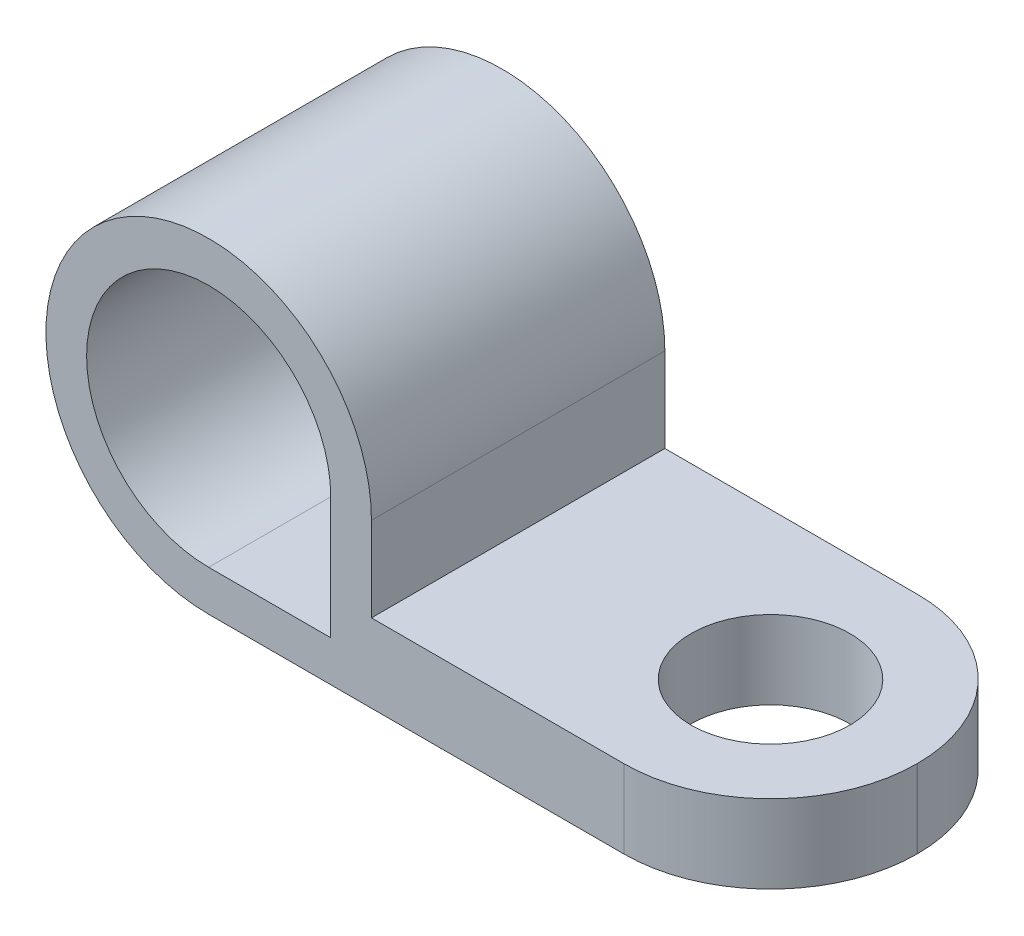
ISO-10303-21;
HEADER;
FILE_DESCRIPTION(('STEP AP214'),'2;1');
FILE_NAME('part.step','',(''),(''),'','','');
FILE_SCHEMA(('AUTOMOTIVE_DESIGN { 1 0 10303 214 1 1 1 1 }'));
ENDSEC;
DATA;
#1=APPLICATION_CONTEXT('core data for automotive mechanical design processes');
#2=APPLICATION_PROTOCOL_DEFINITION('international standard','automotive_design',2000,#1);
#3=PRODUCT_CONTEXT('',#1,'mechanical');
#4=PRODUCT('Part','Part','',(#3));
#5=PRODUCT_RELATED_PRODUCT_CATEGORY('part','',(#4));
#6=PRODUCT_DEFINITION_FORMATION('','',#4);
#7=PRODUCT_DEFINITION_CONTEXT('part definition',#1,'design');
#8=PRODUCT_DEFINITION('design','',#6,#7);
#9=PRODUCT_DEFINITION_SHAPE('','',#8);
#10=(LENGTH_UNIT() NAMED_UNIT(*) SI_UNIT(.MILLI.,.METRE.));
#11=(NAMED_UNIT(*) PLANE_ANGLE_UNIT() SI_UNIT($,.RADIAN.));
#12=(NAMED_UNIT(*) SI_UNIT($,.STERADIAN.) SOLID_ANGLE_UNIT());
#13=UNCERTAINTY_MEASURE_WITH_UNIT(LENGTH_MEASURE(1.E-05),#10,'distance_accuracy_value','');
#14=(GEOMETRIC_REPRESENTATION_CONTEXT(3) GLOBAL_UNCERTAINTY_ASSIGNED_CONTEXT((#13)) GLOBAL_UNIT_ASSIGNED_CONTEXT((#10,
#11,#12)) REPRESENTATION_CONTEXT('',''));
#15=CARTESIAN_POINT('',(0.,0.,0.));
#16=DIRECTION('',(0.,0.,1.));
#17=DIRECTION('',(1.,0.,0.));
#18=AXIS2_PLACEMENT_3D('',#15,#16,#17);
#19=CARTESIAN_POINT('',(0.,0.,4.7625));
#20=DIRECTION('',(0.,0.,1.));
#21=DIRECTION('',(1.,0.,0.));
#22=AXIS2_PLACEMENT_3D('',#19,#20,#21);
#23=PLANE('',#22);
#24=DIRECTION('',(1.,0.,0.));
#25=VECTOR('',#24,1.);
#26=CARTESIAN_POINT('',(0.,-5.2832,4.7625));
#27=LINE('',#26,#25);
#28=CARTESIAN_POINT('',(0.,-5.2832,4.7625));
#29=VERTEX_POINT('',#28);
#30=CARTESIAN_POINT('',(13.4874,-5.2832,4.7625));
#31=VERTEX_POINT('',#30);
#32=EDGE_CURVE('E510',#29,#31,#27,.T.);
#33=ORIENTED_EDGE('',*,*,#32,.T.);
#34=DIRECTION('',(0.,1.,0.));
#35=VECTOR('',#34,1.);
#36=CARTESIAN_POINT('',(13.4874,-2.74319999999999,4.7625));
#37=LINE('',#36,#35);
#38=CARTESIAN_POINT('',(13.4874,-2.7432,4.7625));
#39=VERTEX_POINT('',#38);
#40=EDGE_CURVE('E11',#31,#39,#37,.T.);
#41=ORIENTED_EDGE('',*,*,#40,.T.);
#42=DIRECTION('',(-1.,0.,0.));
#43=VECTOR('',#42,1.);
#44=CARTESIAN_POINT('',(5.2832,-2.7432,4.7625));
#45=LINE('',#44,#43);
#46=CARTESIAN_POINT('',(5.2832,-2.7432,4.7625));
#47=VERTEX_POINT('',#46);
#48=EDGE_CURVE('E512',#39,#47,#45,.T.);
#49=ORIENTED_EDGE('',*,*,#48,.T.);
#50=DIRECTION('',(0.,1.,0.));
#51=VECTOR('',#50,1.);
#52=CARTESIAN_POINT('',(5.2832,0.,4.7625));
#53=LINE('',#52,#51);
#54=CARTESIAN_POINT('',(5.2832,0.,4.7625));
#55=VERTEX_POINT('',#54);
#56=EDGE_CURVE('E514',#47,#55,#53,.T.);
#57=ORIENTED_EDGE('',*,*,#56,.T.);
#58=CARTESIAN_POINT('',(0.,0.,4.7625));
#59=DIRECTION('',(0.,0.,1.));
#60=DIRECTION('',(1.,0.,0.));
#61=AXIS2_PLACEMENT_3D('',#58,#59,#60);
#62=CIRCLE('',#61,5.2832);
#63=EDGE_CURVE('E507',#55,#29,#62,.T.);
#64=ORIENTED_EDGE('',*,*,#63,.T.);
#65=EDGE_LOOP('',(#33,#41,#49,#57,#64));
#66=FACE_BOUND('',#65,.T.);
#67=DIRECTION('',(1.,0.,0.));
#68=VECTOR('',#67,1.);
#69=CARTESIAN_POINT('',(3.9624,-3.9624,4.7625));
#70=LINE('',#69,#68);
#71=CARTESIAN_POINT('',(0.,-3.9624,4.7625));
#72=VERTEX_POINT('',#71);
#73=CARTESIAN_POINT('',(3.9624,-3.9624,4.7625));
#74=VERTEX_POINT('',#73);
#75=EDGE_CURVE('E492',#72,#74,#70,.T.);
#76=ORIENTED_EDGE('',*,*,#75,.F.);
#77=CARTESIAN_POINT('',(0.,0.,4.7625));
#78=DIRECTION('',(0.,0.,1.));
#79=DIRECTION('',(1.,0.,0.));
#80=AXIS2_PLACEMENT_3D('',#77,#78,#79);
#81=CIRCLE('',#80,3.9624);
#82=CARTESIAN_POINT('',(3.9624,0.,4.7625));
#83=VERTEX_POINT('',#82);
#84=EDGE_CURVE('E479',#83,#72,#81,.T.);
#85=ORIENTED_EDGE('',*,*,#84,.F.);
#86=DIRECTION('',(0.,1.,0.));
#87=VECTOR('',#86,1.);
#88=CARTESIAN_POINT('',(3.9624,0.,4.7625));
#89=LINE('',#88,#87);
#90=EDGE_CURVE('E494',#74,#83,#89,.T.);
#91=ORIENTED_EDGE('',*,*,#90,.F.);
#92=EDGE_LOOP('',(#76,#85,#91));
#93=FACE_BOUND('',#92,.T.);
#94=ADVANCED_FACE('F381',(#66,#93),#23,.T.);
#95=CARTESIAN_POINT('',(0.,0.,-4.7625));
#96=DIRECTION('',(0.,0.,1.));
#97=DIRECTION('',(1.,0.,0.));
#98=AXIS2_PLACEMENT_3D('',#95,#96,#97);
#99=PLANE('',#98);
#100=DIRECTION('',(-1.,0.,0.));
#101=VECTOR('',#100,1.);
#102=CARTESIAN_POINT('',(5.2832,-2.7432,-4.7625));
#103=LINE('',#102,#101);
#104=CARTESIAN_POINT('',(13.4874,-2.7432,-4.7625));
#105=VERTEX_POINT('',#104);
#106=CARTESIAN_POINT('',(5.2832,-2.7432,-4.7625));
#107=VERTEX_POINT('',#106);
#108=EDGE_CURVE('E503',#105,#107,#103,.T.);
#109=ORIENTED_EDGE('',*,*,#108,.F.);
#110=DIRECTION('',(0.,1.,0.));
#111=VECTOR('',#110,1.);
#112=CARTESIAN_POINT('',(13.4874,0.,-4.7625));
#113=LINE('',#112,#111);
#114=CARTESIAN_POINT('',(13.4874,-5.2832,-4.7625));
#115=VERTEX_POINT('',#114);
#116=EDGE_CURVE('E404',#105,#115,#113,.F.);
#117=ORIENTED_EDGE('',*,*,#116,.T.);
#118=DIRECTION('',(1.,0.,0.));
#119=VECTOR('',#118,1.);
#120=CARTESIAN_POINT('',(0.,-5.2832,-4.7625));
#121=LINE('',#120,#119);
#122=CARTESIAN_POINT('',(0.,-5.2832,-4.7625));
#123=VERTEX_POINT('',#122);
#124=EDGE_CURVE('E501',#123,#115,#121,.T.);
#125=ORIENTED_EDGE('',*,*,#124,.F.);
#126=CARTESIAN_POINT('',(0.,0.,-4.7625));
#127=DIRECTION('',(0.,0.,1.));
#128=DIRECTION('',(1.,0.,0.));
#129=AXIS2_PLACEMENT_3D('',#126,#127,#128);
#130=CIRCLE('',#129,5.2832);
#131=CARTESIAN_POINT('',(5.2832,0.,-4.7625));
#132=VERTEX_POINT('',#131);
#133=EDGE_CURVE('E480',#132,#123,#130,.T.);
#134=ORIENTED_EDGE('',*,*,#133,.F.);
#135=DIRECTION('',(0.,1.,0.));
#136=VECTOR('',#135,1.);
#137=CARTESIAN_POINT('',(5.2832,0.,-4.7625));
#138=LINE('',#137,#136);
#139=EDGE_CURVE('E505',#107,#132,#138,.T.);
#140=ORIENTED_EDGE('',*,*,#139,.F.);
#141=EDGE_LOOP('',(#109,#117,#125,#134,#140));
#142=FACE_BOUND('',#141,.T.);
#143=CARTESIAN_POINT('',(0.,0.,-4.7625));
#144=DIRECTION('',(0.,0.,1.));
#145=DIRECTION('',(1.,0.,0.));
#146=AXIS2_PLACEMENT_3D('',#143,#144,#145);
#147=CIRCLE('',#146,3.9624);
#148=CARTESIAN_POINT('',(3.9624,0.,-4.7625));
#149=VERTEX_POINT('',#148);
#150=CARTESIAN_POINT('',(0.,-3.9624,-4.7625));
#151=VERTEX_POINT('',#150);
#152=EDGE_CURVE('E472',#149,#151,#147,.T.);
#153=ORIENTED_EDGE('',*,*,#152,.T.);
#154=DIRECTION('',(1.,0.,0.));
#155=VECTOR('',#154,1.);
#156=CARTESIAN_POINT('',(3.9624,-3.9624,-4.7625));
#157=LINE('',#156,#155);
#158=CARTESIAN_POINT('',(3.9624,-3.9624,-4.7625));
#159=VERTEX_POINT('',#158);
#160=EDGE_CURVE('E460',#151,#159,#157,.T.);
#161=ORIENTED_EDGE('',*,*,#160,.T.);
#162=DIRECTION('',(0.,1.,0.));
#163=VECTOR('',#162,1.);
#164=CARTESIAN_POINT('',(3.9624,0.,-4.7625));
#165=LINE('',#164,#163);
#166=EDGE_CURVE('E471',#159,#149,#165,.T.);
#167=ORIENTED_EDGE('',*,*,#166,.T.);
#168=EDGE_LOOP('',(#153,#161,#167));
#169=FACE_BOUND('',#168,.T.);
#170=ADVANCED_FACE('F482',(#142,#169),#99,.F.);
#171=CARTESIAN_POINT('',(0.,0.,4.7625));
#172=DIRECTION('',(0.,0.,-1.));
#173=DIRECTION('',(-1.,0.,0.));
#174=AXIS2_PLACEMENT_3D('',#171,#172,#173);
#175=CYLINDRICAL_SURFACE('',#174,5.2832);
#176=ORIENTED_EDGE('',*,*,#133,.T.);
#177=DIRECTION('',(0.,0.,-1.));
#178=VECTOR('',#177,1.);
#179=CARTESIAN_POINT('',(0.,-5.2832,4.7625));
#180=LINE('',#179,#178);
#181=EDGE_CURVE('E528',#29,#123,#180,.T.);
#182=ORIENTED_EDGE('',*,*,#181,.F.);
#183=ORIENTED_EDGE('',*,*,#63,.F.);
#184=DIRECTION('',(0.,0.,-1.));
#185=VECTOR('',#184,1.);
#186=CARTESIAN_POINT('',(5.2832,0.,4.7625));
#187=LINE('',#186,#185);
#188=EDGE_CURVE('E516',#55,#132,#187,.T.);
#189=ORIENTED_EDGE('',*,*,#188,.T.);
#190=EDGE_LOOP('',(#176,#182,#183,#189));
#191=FACE_BOUND('',#190,.T.);
#192=ADVANCED_FACE('F383',(#191),#175,.T.);
#193=CARTESIAN_POINT('',(0.,-5.2832,4.7625));
#194=DIRECTION('',(0.,1.,0.));
#195=DIRECTION('',(0.,0.,1.));
#196=AXIS2_PLACEMENT_3D('',#193,#194,#195);
#197=PLANE('',#196);
#198=CARTESIAN_POINT('',(13.4874,-5.2832,0.0127));
#199=DIRECTION('',(0.,1.,0.));
#200=DIRECTION('',(0.,0.,1.));
#201=AXIS2_PLACEMENT_3D('',#198,#199,#200);
#202=CIRCLE('',#201,2.5781);
#203=CARTESIAN_POINT('',(13.4874,-5.2832,2.5908));
#204=VERTEX_POINT('',#203);
#205=EDGE_CURVE('E483',#204,#204,#202,.T.);
#206=ORIENTED_EDGE('',*,*,#205,.T.);
#207=EDGE_LOOP('',(#206));
#208=FACE_BOUND('',#207,.T.);
#209=ORIENTED_EDGE('',*,*,#124,.T.);
#210=CARTESIAN_POINT('',(13.4874,-5.2832,-0.0127));
#211=DIRECTION('',(0.,1.,0.));
#212=DIRECTION('',(0.,0.,1.));
#213=AXIS2_PLACEMENT_3D('',#210,#211,#212);
#214=CIRCLE('',#213,4.7498);
#215=CARTESIAN_POINT('',(18.2372,-5.2832,-0.0126999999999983));
#216=VERTEX_POINT('',#215);
#217=EDGE_CURVE('E389',#115,#216,#214,.F.);
#218=ORIENTED_EDGE('',*,*,#217,.T.);
#219=DIRECTION('',(0.,0.,-1.));
#220=VECTOR('',#219,1.);
#221=CARTESIAN_POINT('',(18.2372,-5.2832,4.7625));
#222=LINE('',#221,#220);
#223=CARTESIAN_POINT('',(18.2372,-5.2832,0.0127000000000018));
#224=VERTEX_POINT('',#223);
#225=EDGE_CURVE('E525',#224,#216,#222,.T.);
#226=ORIENTED_EDGE('',*,*,#225,.F.);
#227=CARTESIAN_POINT('',(13.4874,-5.2832,0.0127));
#228=DIRECTION('',(0.,1.,0.));
#229=DIRECTION('',(0.,0.,1.));
#230=AXIS2_PLACEMENT_3D('',#227,#228,#229);
#231=CIRCLE('',#230,4.7498);
#232=EDGE_CURVE('E396',#224,#31,#231,.F.);
#233=ORIENTED_EDGE('',*,*,#232,.T.);
#234=ORIENTED_EDGE('',*,*,#32,.F.);
#235=ORIENTED_EDGE('',*,*,#181,.T.);
#236=EDGE_LOOP('',(#209,#218,#226,#233,#234,#235));
#237=FACE_BOUND('',#236,.T.);
#238=ADVANCED_FACE('F542',(#208,#237),#197,.F.);
#239=CARTESIAN_POINT('',(18.2372,-2.7432,4.7625));
#240=DIRECTION('',(-1.,0.,0.));
#241=DIRECTION('',(0.,-1.,0.));
#242=AXIS2_PLACEMENT_3D('',#239,#240,#241);
#243=PLANE('',#242);
#244=ORIENTED_EDGE('',*,*,#225,.T.);
#245=DIRECTION('',(0.,1.,0.));
#246=VECTOR('',#245,1.);
#247=CARTESIAN_POINT('',(18.2372,-2.7432,-0.0127));
#248=LINE('',#247,#246);
#249=CARTESIAN_POINT('',(18.2372,-2.7432,-0.0126999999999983));
#250=VERTEX_POINT('',#249);
#251=EDGE_CURVE('E533',#216,#250,#248,.T.);
#252=ORIENTED_EDGE('',*,*,#251,.T.);
#253=DIRECTION('',(0.,0.,-1.));
#254=VECTOR('',#253,1.);
#255=CARTESIAN_POINT('',(18.2372,-2.7432,4.7625));
#256=LINE('',#255,#254);
#257=CARTESIAN_POINT('',(18.2372,-2.7432,0.0127000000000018));
#258=VERTEX_POINT('',#257);
#259=EDGE_CURVE('E522',#258,#250,#256,.T.);
#260=ORIENTED_EDGE('',*,*,#259,.F.);
#261=DIRECTION('',(0.,1.,0.));
#262=VECTOR('',#261,1.);
#263=CARTESIAN_POINT('',(18.2372,-5.2832,0.0127));
#264=LINE('',#263,#262);
#265=EDGE_CURVE('E531',#258,#224,#264,.F.);
#266=ORIENTED_EDGE('',*,*,#265,.T.);
#267=EDGE_LOOP('',(#244,#252,#260,#266));
#268=FACE_BOUND('',#267,.T.);
#269=ADVANCED_FACE('F546',(#268),#243,.F.);
#270=CARTESIAN_POINT('',(5.2832,-2.7432,4.7625));
#271=DIRECTION('',(0.,-1.,0.));
#272=DIRECTION('',(0.,0.,-1.));
#273=AXIS2_PLACEMENT_3D('',#270,#271,#272);
#274=PLANE('',#273);
#275=CARTESIAN_POINT('',(13.4874,-2.7432,0.0127));
#276=DIRECTION('',(0.,1.,0.));
#277=DIRECTION('',(0.,0.,1.));
#278=AXIS2_PLACEMENT_3D('',#275,#276,#277);
#279=CIRCLE('',#278,2.5781);
#280=CARTESIAN_POINT('',(13.4874,-2.7432,2.5908));
#281=VERTEX_POINT('',#280);
#282=EDGE_CURVE('E486',#281,#281,#279,.T.);
#283=ORIENTED_EDGE('',*,*,#282,.F.);
#284=EDGE_LOOP('',(#283));
#285=FACE_BOUND('',#284,.T.);
#286=ORIENTED_EDGE('',*,*,#259,.T.);
#287=CARTESIAN_POINT('',(13.4874,-2.7432,-0.0127));
#288=DIRECTION('',(0.,-1.,0.));
#289=DIRECTION('',(0.,0.,-1.));
#290=AXIS2_PLACEMENT_3D('',#287,#288,#289);
#291=CIRCLE('',#290,4.7498);
#292=EDGE_CURVE('E538',#250,#105,#291,.F.);
#293=ORIENTED_EDGE('',*,*,#292,.T.);
#294=ORIENTED_EDGE('',*,*,#108,.T.);
#295=DIRECTION('',(0.,0.,-1.));
#296=VECTOR('',#295,1.);
#297=CARTESIAN_POINT('',(5.2832,-2.7432,4.7625));
#298=LINE('',#297,#296);
#299=EDGE_CURVE('E519',#47,#107,#298,.T.);
#300=ORIENTED_EDGE('',*,*,#299,.F.);
#301=ORIENTED_EDGE('',*,*,#48,.F.);
#302=CARTESIAN_POINT('',(13.4874,-2.7432,0.0127));
#303=DIRECTION('',(0.,-1.,0.));
#304=DIRECTION('',(0.,0.,-1.));
#305=AXIS2_PLACEMENT_3D('',#302,#303,#304);
#306=CIRCLE('',#305,4.7498);
#307=EDGE_CURVE('E536',#39,#258,#306,.F.);
#308=ORIENTED_EDGE('',*,*,#307,.T.);
#309=EDGE_LOOP('',(#286,#293,#294,#300,#301,#308));
#310=FACE_BOUND('',#309,.T.);
#311=ADVANCED_FACE('F551',(#285,#310),#274,.F.);
#312=CARTESIAN_POINT('',(5.2832,0.,4.7625));
#313=DIRECTION('',(-1.,0.,0.));
#314=DIRECTION('',(0.,-1.,0.));
#315=AXIS2_PLACEMENT_3D('',#312,#313,#314);
#316=PLANE('',#315);
#317=ORIENTED_EDGE('',*,*,#139,.T.);
#318=ORIENTED_EDGE('',*,*,#188,.F.);
#319=ORIENTED_EDGE('',*,*,#56,.F.);
#320=ORIENTED_EDGE('',*,*,#299,.T.);
#321=EDGE_LOOP('',(#317,#318,#319,#320));
#322=FACE_BOUND('',#321,.T.);
#323=ADVANCED_FACE('F557',(#322),#316,.F.);
#324=CARTESIAN_POINT('',(0.,0.,4.7625));
#325=DIRECTION('',(0.,0.,-1.));
#326=DIRECTION('',(-1.,0.,0.));
#327=AXIS2_PLACEMENT_3D('',#324,#325,#326);
#328=CYLINDRICAL_SURFACE('',#327,3.9624);
#329=ORIENTED_EDGE('',*,*,#152,.F.);
#330=DIRECTION('',(0.,0.,-1.));
#331=VECTOR('',#330,1.);
#332=CARTESIAN_POINT('',(3.9624,0.,4.7625));
#333=LINE('',#332,#331);
#334=EDGE_CURVE('E496',#83,#149,#333,.T.);
#335=ORIENTED_EDGE('',*,*,#334,.F.);
#336=ORIENTED_EDGE('',*,*,#84,.T.);
#337=DIRECTION('',(0.,0.,-1.));
#338=VECTOR('',#337,1.);
#339=CARTESIAN_POINT('',(0.,-3.9624,4.7625));
#340=LINE('',#339,#338);
#341=EDGE_CURVE('E464',#72,#151,#340,.T.);
#342=ORIENTED_EDGE('',*,*,#341,.T.);
#343=EDGE_LOOP('',(#329,#335,#336,#342));
#344=FACE_BOUND('',#343,.T.);
#345=ADVANCED_FACE('F475',(#344),#328,.F.);
#346=CARTESIAN_POINT('',(3.9624,-3.9624,4.7625));
#347=DIRECTION('',(0.,1.,0.));
#348=DIRECTION('',(-1.,0.,0.));
#349=AXIS2_PLACEMENT_3D('',#346,#347,#348);
#350=PLANE('',#349);
#351=ORIENTED_EDGE('',*,*,#160,.F.);
#352=ORIENTED_EDGE('',*,*,#341,.F.);
#353=ORIENTED_EDGE('',*,*,#75,.T.);
#354=DIRECTION('',(0.,0.,-1.));
#355=VECTOR('',#354,1.);
#356=CARTESIAN_POINT('',(3.9624,-3.9624,4.7625));
#357=LINE('',#356,#355);
#358=EDGE_CURVE('E466',#74,#159,#357,.T.);
#359=ORIENTED_EDGE('',*,*,#358,.T.);
#360=EDGE_LOOP('',(#351,#352,#353,#359));
#361=FACE_BOUND('',#360,.T.);
#362=ADVANCED_FACE('F462',(#361),#350,.T.);
#363=CARTESIAN_POINT('',(3.9624,0.,4.7625));
#364=DIRECTION('',(-1.,0.,0.));
#365=DIRECTION('',(0.,-1.,0.));
#366=AXIS2_PLACEMENT_3D('',#363,#364,#365);
#367=PLANE('',#366);
#368=ORIENTED_EDGE('',*,*,#166,.F.);
#369=ORIENTED_EDGE('',*,*,#358,.F.);
#370=ORIENTED_EDGE('',*,*,#90,.T.);
#371=ORIENTED_EDGE('',*,*,#334,.T.);
#372=EDGE_LOOP('',(#368,#369,#370,#371));
#373=FACE_BOUND('',#372,.T.);
#374=ADVANCED_FACE('F578',(#373),#367,.T.);
#375=CARTESIAN_POINT('',(13.4874,-2.74319999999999,-0.0127));
#376=DIRECTION('',(0.,1.,0.));
#377=DIRECTION('',(-1.,0.,0.));
#378=AXIS2_PLACEMENT_3D('',#375,#376,#377);
#379=CYLINDRICAL_SURFACE('',#378,4.7498);
#380=ORIENTED_EDGE('',*,*,#217,.F.);
#381=ORIENTED_EDGE('',*,*,#116,.F.);
#382=ORIENTED_EDGE('',*,*,#292,.F.);
#383=ORIENTED_EDGE('',*,*,#251,.F.);
#384=EDGE_LOOP('',(#380,#381,#382,#383));
#385=FACE_BOUND('',#384,.T.);
#386=ADVANCED_FACE('F549',(#385),#379,.T.);
#387=CARTESIAN_POINT('',(13.4874,0.,0.0127));
#388=DIRECTION('',(0.,-1.,0.));
#389=DIRECTION('',(1.,0.,0.));
#390=AXIS2_PLACEMENT_3D('',#387,#388,#389);
#391=CYLINDRICAL_SURFACE('',#390,4.7498);
#392=ORIENTED_EDGE('',*,*,#232,.F.);
#393=ORIENTED_EDGE('',*,*,#265,.F.);
#394=ORIENTED_EDGE('',*,*,#307,.F.);
#395=ORIENTED_EDGE('',*,*,#40,.F.);
#396=EDGE_LOOP('',(#392,#393,#394,#395));
#397=FACE_BOUND('',#396,.T.);
#398=ADVANCED_FACE('F567',(#397),#391,.T.);
#399=CARTESIAN_POINT('',(13.4874,-5.2832,0.0127));
#400=DIRECTION('',(0.,1.,0.));
#401=DIRECTION('',(0.,0.,1.));
#402=AXIS2_PLACEMENT_3D('',#399,#400,#401);
#403=CYLINDRICAL_SURFACE('',#402,2.5781);
#404=ORIENTED_EDGE('',*,*,#205,.F.);
#405=EDGE_LOOP('',(#404));
#406=FACE_BOUND('',#405,.T.);
#407=ORIENTED_EDGE('',*,*,#282,.T.);
#408=EDGE_LOOP('',(#407));
#409=FACE_BOUND('',#408,.T.);
#410=ADVANCED_FACE('F569',(#406,#409),#403,.F.);
#411=CLOSED_SHELL('',(#94,#170,#192,#238,#269,#311,#323,#345,#362,#374,#386,#398,#410));
#412=MANIFOLD_SOLID_BREP('B2',#411);
#413=ADVANCED_BREP_SHAPE_REPRESENTATION('',(#18,#412),#14);
#414=SHAPE_DEFINITION_REPRESENTATION(#9,#413);
ENDSEC;
END-ISO-10303-21;
